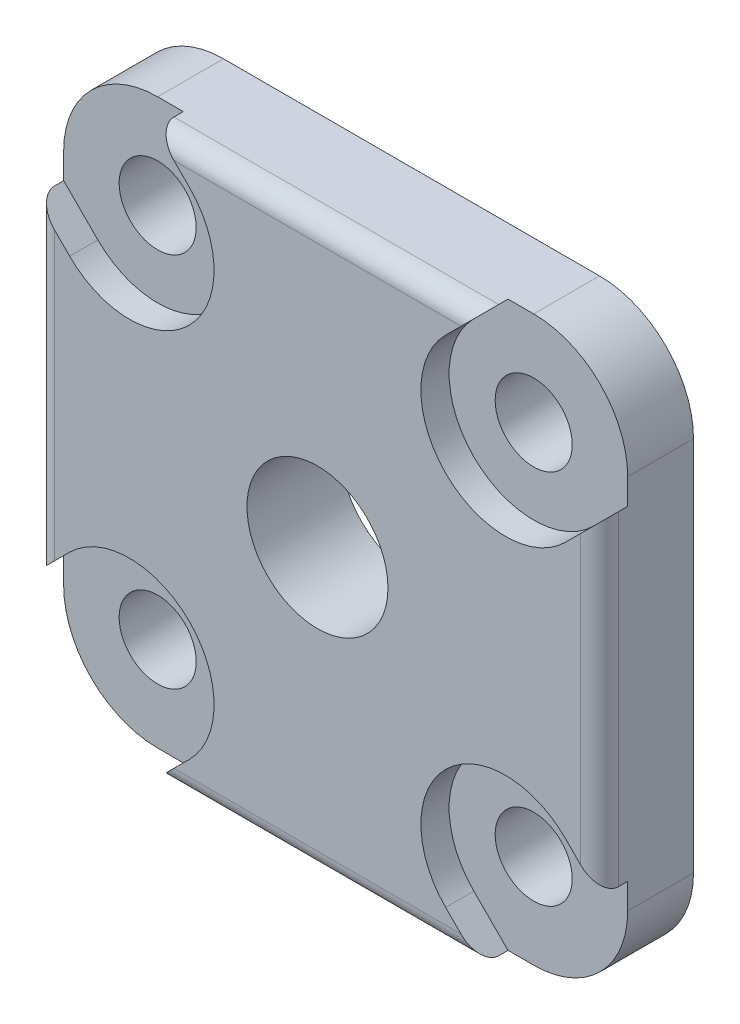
from build123d import *

# Parameters (mm, degrees)
BOSS_EXTRUDE1_DEPTH        = 5
SKETCH3_R                  = 7.5
CUT_EXTRUDE1_DEPTH         = 10
F_8_2_8_2_DIAMETER_HOLE1_D = 8.2
CUT_EXTRUDE2_DEPTH         = 3
MIRROR2_COPY_1_DEPTH       = 3
FILLET1_R                  = 2


with BuildPart() as part:
    # Sketch2 → Boss-Extrude1 (new, symmetric)
    with BuildSketch(Plane.XY):
        with BuildLine():
            Line((-20, 30), (20, 30))
            ThreePointArc((20, 30), (27.071067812, 27.071067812), (30, 20))
            Line((30, 20), (30, -20))
            ThreePointArc((30, -20), (27.071067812, -27.071067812), (20, -30))
            Line((20, -30), (-20, -30))
            ThreePointArc((-20, -30), (-27.071067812, -27.071067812), (-30, -20))
            Line((-30, -20), (-30, 20))
            ThreePointArc((-30, 20), (-27.071067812, 27.071067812), (-20, 30))
        make_face()
    extrude(amount=BOSS_EXTRUDE1_DEPTH, both=True)

    # Sketch3 → Cut-Extrude1 (cut)
    with BuildSketch(Plane.XY.offset(5)):
        Circle(SKETCH3_R)
    extrude(amount=-CUT_EXTRUDE1_DEPTH, mode=Mode.SUBTRACT)

    # 8.2 _8.2_ Diameter Hole1 (through all)
    with Locations(Plane(origin=(0, 0, -5), x_dir=(-1, 0, 0), z_dir=(0, 0, -1))):
        with Locations((-20, 20), (20, 20), (20, -20), (-20, -20)):
            Hole(F_8_2_8_2_DIAMETER_HOLE1_D / 2)

    # Sketch9 → Cut-Extrude2 (cut)
    with BuildSketch(Plane(origin=(0, 0, 5), x_dir=(-1, 0, 0), z_dir=(0, 0, -1))):
        with BuildLine():
            Line((-13.636038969, 26.363961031), (-17.272077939, 30))
            Line((-17.272077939, 30), (-20, 30))
            ThreePointArc((-20, 30), (-27.071067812, 27.071067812), (-30, 20))
            Line((-30, 20), (-30, 17.272077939))
            Line((-30, 17.272077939), (-26.363961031, 13.636038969))
            ThreePointArc((-26.363961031, 13.636038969), (-13.636038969, 13.636038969), (-13.636038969, 26.363961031))
        make_face()
    cut_extrude2 = extrude(amount=CUT_EXTRUDE2_DEPTH, mode=Mode.SUBTRACT)

    # Mirror1: Cut-Extrude2 across plane
    add(cut_extrude2.mirror(Plane.ZX), mode=Mode.SUBTRACT)

    # Mirror2: Cut-Extrude2 across plane
    add(cut_extrude2.mirror(Plane(origin=(0, 0, 0), x_dir=(0, 0, 1), z_dir=(1, 0, 0))), mode=Mode.SUBTRACT)

    # Mirror2 copy 1 sketch → Mirror2 copy 1 (cut)
    with BuildSketch(Plane(origin=(0, 0, 5), x_dir=(1, 0, 0), z_dir=(0, 0, -1))):
        with BuildLine():
            Line((-13.636038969, 26.363961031), (-17.272077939, 30))
            Line((-17.272077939, 30), (-20, 30))
            ThreePointArc((-20, 30), (-27.071067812, 27.071067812), (-30, 20))
            Line((-30, 20), (-30, 17.272077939))
            Line((-30, 17.272077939), (-26.363961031, 13.636038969))
            ThreePointArc((-26.363961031, 13.636038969), (-13.636038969, 13.636038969), (-13.636038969, 26.363961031))
        make_face()
    extrude(amount=MIRROR2_COPY_1_DEPTH, mode=Mode.SUBTRACT)

    # Fillet1
    fillet1_edges = [part.edges().sort_by_distance(p)[0] for p in [
        (0, -30, 5),
        (0, 30, 5),
        (30, 0, 5),
        (-30, 0, 5),
    ]]
    fillet(fillet1_edges, radius=FILLET1_R)


solid = part.part
